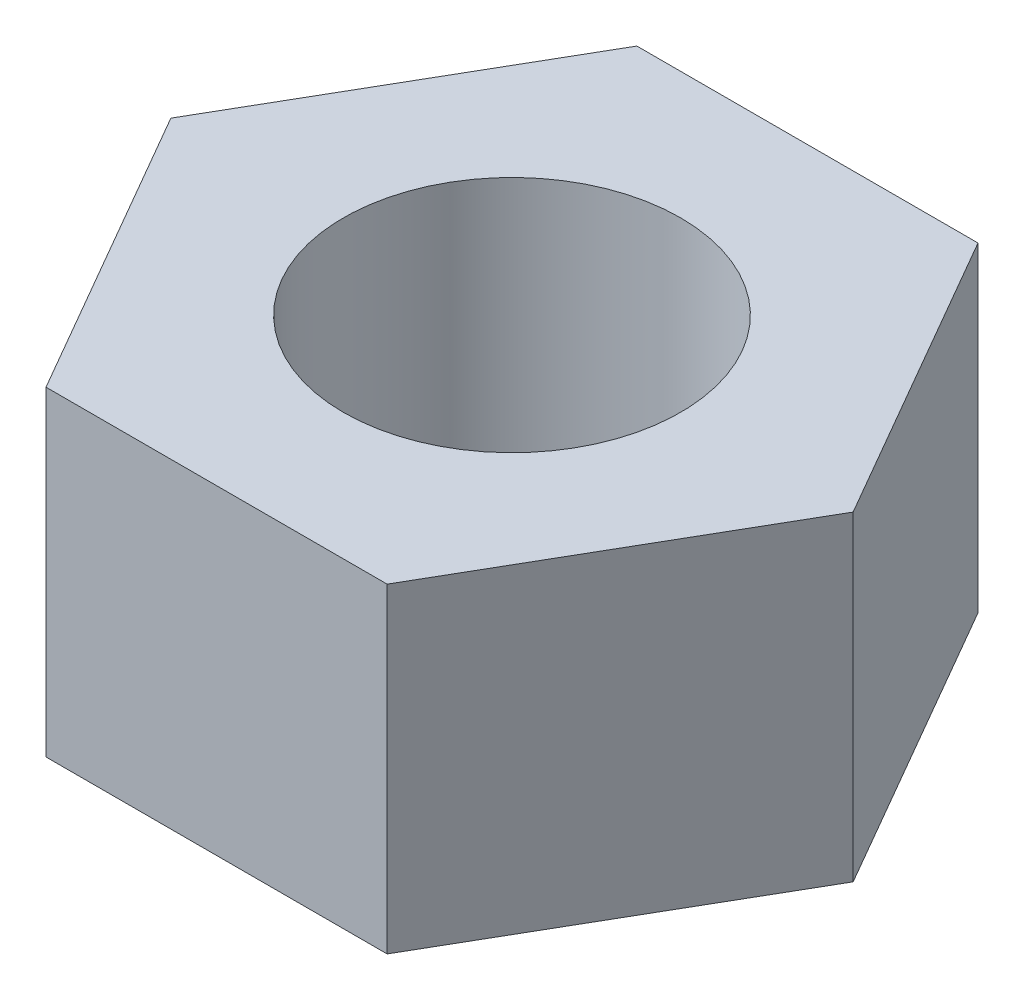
from build123d import *

# Parameters (mm, degrees)
SKETCH1_R           = 2
BOSS_EXTRUDE1_DEPTH = 3.8


with BuildPart() as part:
    # Sketch1 → Boss-Extrude1 (new body)
    with BuildSketch(Plane(origin=(0, 0, 0), x_dir=(1, 0, 0), z_dir=(0, 1, 0))):
        Polygon((-2.023728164, 3.5052), (-4.047456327, 0), (-2.023728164, -3.5052), (2.023728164, -3.5052), (4.047456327, 0), (2.023728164, 3.5052), align=None)
        with Locations(Location((0, 0, 0), (0, 0, 90))):
            Circle(SKETCH1_R, mode=Mode.SUBTRACT)
    extrude(amount=BOSS_EXTRUDE1_DEPTH)


solid = part.part
